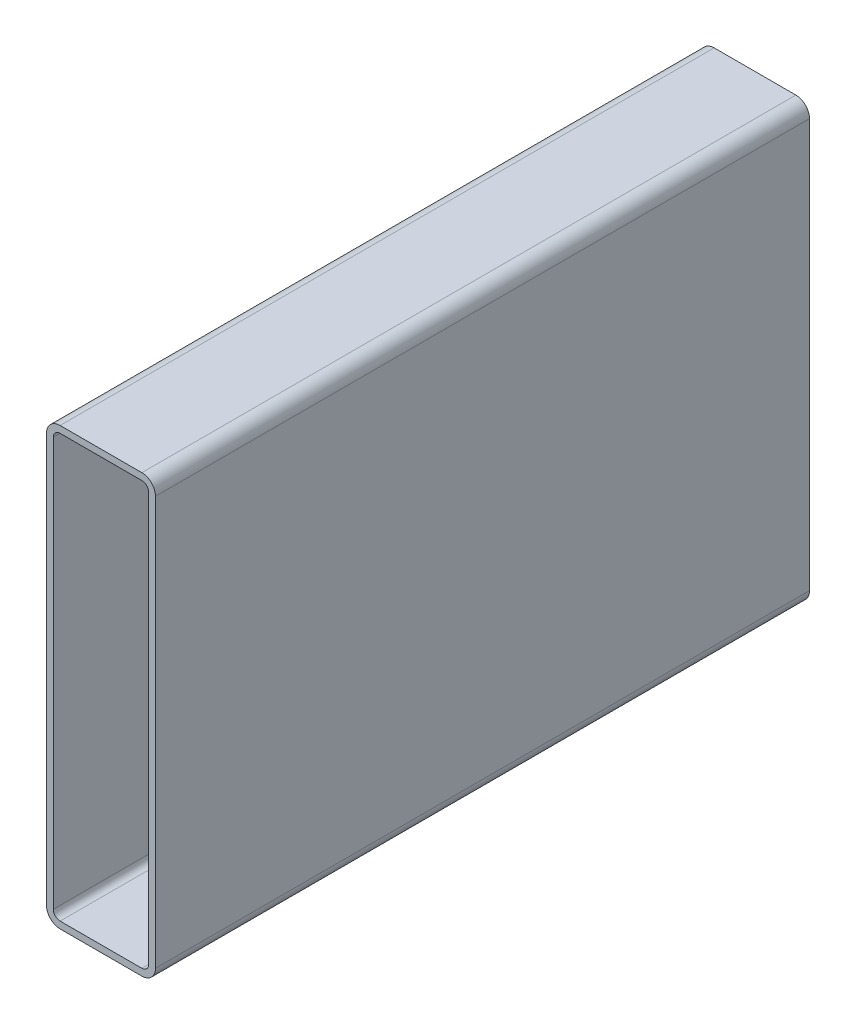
ISO-10303-21;
HEADER;
FILE_DESCRIPTION(('STEP AP214'),'2;1');
FILE_NAME('part.step','',(''),(''),'','','');
FILE_SCHEMA(('AUTOMOTIVE_DESIGN { 1 0 10303 214 1 1 1 1 }'));
ENDSEC;
DATA;
#1=APPLICATION_CONTEXT('core data for automotive mechanical design processes');
#2=APPLICATION_PROTOCOL_DEFINITION('international standard','automotive_design',2000,#1);
#3=PRODUCT_CONTEXT('',#1,'mechanical');
#4=PRODUCT('Part','Part','',(#3));
#5=PRODUCT_RELATED_PRODUCT_CATEGORY('part','',(#4));
#6=PRODUCT_DEFINITION_FORMATION('','',#4);
#7=PRODUCT_DEFINITION_CONTEXT('part definition',#1,'design');
#8=PRODUCT_DEFINITION('design','',#6,#7);
#9=PRODUCT_DEFINITION_SHAPE('','',#8);
#10=(LENGTH_UNIT() NAMED_UNIT(*) SI_UNIT(.MILLI.,.METRE.));
#11=(NAMED_UNIT(*) PLANE_ANGLE_UNIT() SI_UNIT($,.RADIAN.));
#12=(NAMED_UNIT(*) SI_UNIT($,.STERADIAN.) SOLID_ANGLE_UNIT());
#13=UNCERTAINTY_MEASURE_WITH_UNIT(LENGTH_MEASURE(1.E-05),#10,'distance_accuracy_value','');
#14=(GEOMETRIC_REPRESENTATION_CONTEXT(3) GLOBAL_UNCERTAINTY_ASSIGNED_CONTEXT((#13)) GLOBAL_UNIT_ASSIGNED_CONTEXT((#10,
#11,#12)) REPRESENTATION_CONTEXT('',''));
#15=CARTESIAN_POINT('',(0.,0.,0.));
#16=DIRECTION('',(0.,0.,1.));
#17=DIRECTION('',(1.,0.,0.));
#18=AXIS2_PLACEMENT_3D('',#15,#16,#17);
#19=CARTESIAN_POINT('',(6.35,196.85,304.8));
#20=DIRECTION('',(0.,0.,1.));
#21=DIRECTION('',(1.,0.,0.));
#22=AXIS2_PLACEMENT_3D('',#19,#20,#21);
#23=PLANE('',#22);
#24=CARTESIAN_POINT('',(6.35,196.85,304.8));
#25=DIRECTION('',(0.,0.,1.));
#26=DIRECTION('',(1.,0.,0.));
#27=AXIS2_PLACEMENT_3D('',#24,#25,#26);
#28=CIRCLE('',#27,6.35);
#29=CARTESIAN_POINT('',(6.35,203.2,304.8));
#30=VERTEX_POINT('',#29);
#31=CARTESIAN_POINT('',(0.,196.85,304.8));
#32=VERTEX_POINT('',#31);
#33=EDGE_CURVE('E211',#30,#32,#28,.T.);
#34=ORIENTED_EDGE('',*,*,#33,.T.);
#35=DIRECTION('',(0.,-1.,0.));
#36=VECTOR('',#35,1.);
#37=CARTESIAN_POINT('',(0.,6.35,304.8));
#38=LINE('',#37,#36);
#39=CARTESIAN_POINT('',(0.,6.35,304.8));
#40=VERTEX_POINT('',#39);
#41=EDGE_CURVE('E214',#32,#40,#38,.T.);
#42=ORIENTED_EDGE('',*,*,#41,.T.);
#43=CARTESIAN_POINT('',(6.35,6.35,304.8));
#44=DIRECTION('',(0.,0.,1.));
#45=DIRECTION('',(1.,0.,0.));
#46=AXIS2_PLACEMENT_3D('',#43,#44,#45);
#47=CIRCLE('',#46,6.35);
#48=CARTESIAN_POINT('',(6.35,0.,304.8));
#49=VERTEX_POINT('',#48);
#50=EDGE_CURVE('E217',#40,#49,#47,.T.);
#51=ORIENTED_EDGE('',*,*,#50,.T.);
#52=DIRECTION('',(1.,0.,0.));
#53=VECTOR('',#52,1.);
#54=CARTESIAN_POINT('',(44.45,0.,304.8));
#55=LINE('',#54,#53);
#56=CARTESIAN_POINT('',(44.45,0.,304.8));
#57=VERTEX_POINT('',#56);
#58=EDGE_CURVE('E219',#49,#57,#55,.T.);
#59=ORIENTED_EDGE('',*,*,#58,.T.);
#60=CARTESIAN_POINT('',(44.45,6.35,304.8));
#61=DIRECTION('',(0.,0.,1.));
#62=DIRECTION('',(1.,0.,0.));
#63=AXIS2_PLACEMENT_3D('',#60,#61,#62);
#64=CIRCLE('',#63,6.35);
#65=CARTESIAN_POINT('',(50.8,6.35,304.8));
#66=VERTEX_POINT('',#65);
#67=EDGE_CURVE('E221',#57,#66,#64,.T.);
#68=ORIENTED_EDGE('',*,*,#67,.T.);
#69=DIRECTION('',(0.,1.,0.));
#70=VECTOR('',#69,1.);
#71=CARTESIAN_POINT('',(50.8,196.85,304.8));
#72=LINE('',#71,#70);
#73=CARTESIAN_POINT('',(50.8,196.85,304.8));
#74=VERTEX_POINT('',#73);
#75=EDGE_CURVE('E223',#66,#74,#72,.T.);
#76=ORIENTED_EDGE('',*,*,#75,.T.);
#77=CARTESIAN_POINT('',(44.45,196.85,304.8));
#78=DIRECTION('',(0.,0.,1.));
#79=DIRECTION('',(1.,0.,0.));
#80=AXIS2_PLACEMENT_3D('',#77,#78,#79);
#81=CIRCLE('',#80,6.35);
#82=CARTESIAN_POINT('',(44.45,203.2,304.8));
#83=VERTEX_POINT('',#82);
#84=EDGE_CURVE('E225',#74,#83,#81,.T.);
#85=ORIENTED_EDGE('',*,*,#84,.T.);
#86=DIRECTION('',(-1.,0.,0.));
#87=VECTOR('',#86,1.);
#88=CARTESIAN_POINT('',(6.35,203.2,304.8));
#89=LINE('',#88,#87);
#90=EDGE_CURVE('E227',#83,#30,#89,.T.);
#91=ORIENTED_EDGE('',*,*,#90,.T.);
#92=EDGE_LOOP('',(#34,#42,#51,#59,#68,#76,#85,#91));
#93=FACE_BOUND('',#92,.T.);
#94=DIRECTION('',(0.,-1.,0.));
#95=VECTOR('',#94,1.);
#96=CARTESIAN_POINT('',(3.175,6.35,304.8));
#97=LINE('',#96,#95);
#98=CARTESIAN_POINT('',(3.175,196.85,304.8));
#99=VERTEX_POINT('',#98);
#100=CARTESIAN_POINT('',(3.175,6.35,304.8));
#101=VERTEX_POINT('',#100);
#102=EDGE_CURVE('E154',#99,#101,#97,.T.);
#103=ORIENTED_EDGE('',*,*,#102,.F.);
#104=CARTESIAN_POINT('',(6.35,196.85,304.8));
#105=DIRECTION('',(0.,0.,1.));
#106=DIRECTION('',(1.,0.,0.));
#107=AXIS2_PLACEMENT_3D('',#104,#105,#106);
#108=CIRCLE('',#107,3.17499999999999);
#109=CARTESIAN_POINT('',(6.35,200.025,304.8));
#110=VERTEX_POINT('',#109);
#111=EDGE_CURVE('E146',#110,#99,#108,.T.);
#112=ORIENTED_EDGE('',*,*,#111,.F.);
#113=DIRECTION('',(-1.,0.,0.));
#114=VECTOR('',#113,1.);
#115=CARTESIAN_POINT('',(6.35,200.025,304.8));
#116=LINE('',#115,#114);
#117=CARTESIAN_POINT('',(44.45,200.025,304.8));
#118=VERTEX_POINT('',#117);
#119=EDGE_CURVE('E179',#118,#110,#116,.T.);
#120=ORIENTED_EDGE('',*,*,#119,.F.);
#121=CARTESIAN_POINT('',(44.45,196.85,304.8));
#122=DIRECTION('',(0.,0.,1.));
#123=DIRECTION('',(1.,0.,0.));
#124=AXIS2_PLACEMENT_3D('',#121,#122,#123);
#125=CIRCLE('',#124,3.17499999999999);
#126=CARTESIAN_POINT('',(47.625,196.85,304.8));
#127=VERTEX_POINT('',#126);
#128=EDGE_CURVE('E177',#127,#118,#125,.T.);
#129=ORIENTED_EDGE('',*,*,#128,.F.);
#130=DIRECTION('',(0.,1.,0.));
#131=VECTOR('',#130,1.);
#132=CARTESIAN_POINT('',(47.625,196.85,304.8));
#133=LINE('',#132,#131);
#134=CARTESIAN_POINT('',(47.625,6.35,304.8));
#135=VERTEX_POINT('',#134);
#136=EDGE_CURVE('E175',#135,#127,#133,.T.);
#137=ORIENTED_EDGE('',*,*,#136,.F.);
#138=CARTESIAN_POINT('',(44.45,6.35,304.8));
#139=DIRECTION('',(0.,0.,1.));
#140=DIRECTION('',(1.,0.,0.));
#141=AXIS2_PLACEMENT_3D('',#138,#139,#140);
#142=CIRCLE('',#141,3.175);
#143=CARTESIAN_POINT('',(44.45,3.175,304.8));
#144=VERTEX_POINT('',#143);
#145=EDGE_CURVE('E173',#144,#135,#142,.T.);
#146=ORIENTED_EDGE('',*,*,#145,.F.);
#147=DIRECTION('',(1.,0.,0.));
#148=VECTOR('',#147,1.);
#149=CARTESIAN_POINT('',(44.45,3.175,304.8));
#150=LINE('',#149,#148);
#151=CARTESIAN_POINT('',(6.35,3.175,304.8));
#152=VERTEX_POINT('',#151);
#153=EDGE_CURVE('E169',#152,#144,#150,.T.);
#154=ORIENTED_EDGE('',*,*,#153,.F.);
#155=CARTESIAN_POINT('',(6.35,6.35,304.8));
#156=DIRECTION('',(0.,0.,1.));
#157=DIRECTION('',(1.,0.,0.));
#158=AXIS2_PLACEMENT_3D('',#155,#156,#157);
#159=CIRCLE('',#158,3.175);
#160=EDGE_CURVE('E167',#101,#152,#159,.T.);
#161=ORIENTED_EDGE('',*,*,#160,.F.);
#162=EDGE_LOOP('',(#103,#112,#120,#129,#137,#146,#154,#161));
#163=FACE_BOUND('',#162,.T.);
#164=ADVANCED_FACE('F33',(#93,#163),#23,.T.);
#165=CARTESIAN_POINT('',(6.35,196.85,0.));
#166=DIRECTION('',(0.,0.,1.));
#167=DIRECTION('',(1.,0.,0.));
#168=AXIS2_PLACEMENT_3D('',#165,#166,#167);
#169=PLANE('',#168);
#170=CARTESIAN_POINT('',(6.35,196.85,0.));
#171=DIRECTION('',(0.,0.,1.));
#172=DIRECTION('',(1.,0.,0.));
#173=AXIS2_PLACEMENT_3D('',#170,#171,#172);
#174=CIRCLE('',#173,6.35);
#175=CARTESIAN_POINT('',(6.35,203.2,0.));
#176=VERTEX_POINT('',#175);
#177=CARTESIAN_POINT('',(0.,196.85,0.));
#178=VERTEX_POINT('',#177);
#179=EDGE_CURVE('E162',#176,#178,#174,.T.);
#180=ORIENTED_EDGE('',*,*,#179,.F.);
#181=DIRECTION('',(-1.,0.,0.));
#182=VECTOR('',#181,1.);
#183=CARTESIAN_POINT('',(6.35,203.2,0.));
#184=LINE('',#183,#182);
#185=CARTESIAN_POINT('',(44.45,203.2,0.));
#186=VERTEX_POINT('',#185);
#187=EDGE_CURVE('E215',#186,#176,#184,.T.);
#188=ORIENTED_EDGE('',*,*,#187,.F.);
#189=CARTESIAN_POINT('',(44.45,196.85,0.));
#190=DIRECTION('',(0.,0.,1.));
#191=DIRECTION('',(1.,0.,0.));
#192=AXIS2_PLACEMENT_3D('',#189,#190,#191);
#193=CIRCLE('',#192,6.35);
#194=CARTESIAN_POINT('',(50.8,196.85,0.));
#195=VERTEX_POINT('',#194);
#196=EDGE_CURVE('E242',#195,#186,#193,.T.);
#197=ORIENTED_EDGE('',*,*,#196,.F.);
#198=DIRECTION('',(0.,1.,0.));
#199=VECTOR('',#198,1.);
#200=CARTESIAN_POINT('',(50.8,196.85,0.));
#201=LINE('',#200,#199);
#202=CARTESIAN_POINT('',(50.8,6.35,0.));
#203=VERTEX_POINT('',#202);
#204=EDGE_CURVE('E240',#203,#195,#201,.T.);
#205=ORIENTED_EDGE('',*,*,#204,.F.);
#206=CARTESIAN_POINT('',(44.45,6.35,0.));
#207=DIRECTION('',(0.,0.,1.));
#208=DIRECTION('',(1.,0.,0.));
#209=AXIS2_PLACEMENT_3D('',#206,#207,#208);
#210=CIRCLE('',#209,6.35);
#211=CARTESIAN_POINT('',(44.45,0.,0.));
#212=VERTEX_POINT('',#211);
#213=EDGE_CURVE('E238',#212,#203,#210,.T.);
#214=ORIENTED_EDGE('',*,*,#213,.F.);
#215=DIRECTION('',(1.,0.,0.));
#216=VECTOR('',#215,1.);
#217=CARTESIAN_POINT('',(44.45,0.,0.));
#218=LINE('',#217,#216);
#219=CARTESIAN_POINT('',(6.35,0.,0.));
#220=VERTEX_POINT('',#219);
#221=EDGE_CURVE('E236',#220,#212,#218,.T.);
#222=ORIENTED_EDGE('',*,*,#221,.F.);
#223=CARTESIAN_POINT('',(6.35,6.35,0.));
#224=DIRECTION('',(0.,0.,1.));
#225=DIRECTION('',(1.,0.,0.));
#226=AXIS2_PLACEMENT_3D('',#223,#224,#225);
#227=CIRCLE('',#226,6.35);
#228=CARTESIAN_POINT('',(0.,6.35,0.));
#229=VERTEX_POINT('',#228);
#230=EDGE_CURVE('E234',#229,#220,#227,.T.);
#231=ORIENTED_EDGE('',*,*,#230,.F.);
#232=DIRECTION('',(0.,-1.,0.));
#233=VECTOR('',#232,1.);
#234=CARTESIAN_POINT('',(0.,6.35,0.));
#235=LINE('',#234,#233);
#236=EDGE_CURVE('E232',#178,#229,#235,.T.);
#237=ORIENTED_EDGE('',*,*,#236,.F.);
#238=EDGE_LOOP('',(#180,#188,#197,#205,#214,#222,#231,#237));
#239=FACE_BOUND('',#238,.T.);
#240=CARTESIAN_POINT('',(6.35,196.85,0.));
#241=DIRECTION('',(0.,0.,1.));
#242=DIRECTION('',(1.,0.,0.));
#243=AXIS2_PLACEMENT_3D('',#240,#241,#242);
#244=CIRCLE('',#243,3.17499999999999);
#245=CARTESIAN_POINT('',(6.35,200.025,0.));
#246=VERTEX_POINT('',#245);
#247=CARTESIAN_POINT('',(3.175,196.85,0.));
#248=VERTEX_POINT('',#247);
#249=EDGE_CURVE('E56',#246,#248,#244,.T.);
#250=ORIENTED_EDGE('',*,*,#249,.T.);
#251=DIRECTION('',(0.,-1.,0.));
#252=VECTOR('',#251,1.);
#253=CARTESIAN_POINT('',(3.175,6.35,0.));
#254=LINE('',#253,#252);
#255=CARTESIAN_POINT('',(3.175,6.35,0.));
#256=VERTEX_POINT('',#255);
#257=EDGE_CURVE('E161',#248,#256,#254,.T.);
#258=ORIENTED_EDGE('',*,*,#257,.T.);
#259=CARTESIAN_POINT('',(6.35,6.35,0.));
#260=DIRECTION('',(0.,0.,1.));
#261=DIRECTION('',(1.,0.,0.));
#262=AXIS2_PLACEMENT_3D('',#259,#260,#261);
#263=CIRCLE('',#262,3.175);
#264=CARTESIAN_POINT('',(6.35,3.175,0.));
#265=VERTEX_POINT('',#264);
#266=EDGE_CURVE('E183',#256,#265,#263,.T.);
#267=ORIENTED_EDGE('',*,*,#266,.T.);
#268=DIRECTION('',(1.,0.,0.));
#269=VECTOR('',#268,1.);
#270=CARTESIAN_POINT('',(44.45,3.175,0.));
#271=LINE('',#270,#269);
#272=CARTESIAN_POINT('',(44.45,3.175,0.));
#273=VERTEX_POINT('',#272);
#274=EDGE_CURVE('E186',#265,#273,#271,.T.);
#275=ORIENTED_EDGE('',*,*,#274,.T.);
#276=CARTESIAN_POINT('',(44.45,6.35,0.));
#277=DIRECTION('',(0.,0.,1.));
#278=DIRECTION('',(1.,0.,0.));
#279=AXIS2_PLACEMENT_3D('',#276,#277,#278);
#280=CIRCLE('',#279,3.175);
#281=CARTESIAN_POINT('',(47.625,6.35,0.));
#282=VERTEX_POINT('',#281);
#283=EDGE_CURVE('E189',#273,#282,#280,.T.);
#284=ORIENTED_EDGE('',*,*,#283,.T.);
#285=DIRECTION('',(0.,1.,0.));
#286=VECTOR('',#285,1.);
#287=CARTESIAN_POINT('',(47.625,196.85,0.));
#288=LINE('',#287,#286);
#289=CARTESIAN_POINT('',(47.625,196.85,0.));
#290=VERTEX_POINT('',#289);
#291=EDGE_CURVE('E192',#282,#290,#288,.T.);
#292=ORIENTED_EDGE('',*,*,#291,.T.);
#293=CARTESIAN_POINT('',(44.45,196.85,0.));
#294=DIRECTION('',(0.,0.,1.));
#295=DIRECTION('',(1.,0.,0.));
#296=AXIS2_PLACEMENT_3D('',#293,#294,#295);
#297=CIRCLE('',#296,3.17499999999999);
#298=CARTESIAN_POINT('',(44.45,200.025,0.));
#299=VERTEX_POINT('',#298);
#300=EDGE_CURVE('E195',#290,#299,#297,.T.);
#301=ORIENTED_EDGE('',*,*,#300,.T.);
#302=DIRECTION('',(-1.,0.,0.));
#303=VECTOR('',#302,1.);
#304=CARTESIAN_POINT('',(6.35,200.025,0.));
#305=LINE('',#304,#303);
#306=EDGE_CURVE('E155',#299,#246,#305,.T.);
#307=ORIENTED_EDGE('',*,*,#306,.T.);
#308=EDGE_LOOP('',(#250,#258,#267,#275,#284,#292,#301,#307));
#309=FACE_BOUND('',#308,.T.);
#310=ADVANCED_FACE('F272',(#239,#309),#169,.F.);
#311=CARTESIAN_POINT('',(6.35,196.85,304.8));
#312=DIRECTION('',(0.,0.,-1.));
#313=DIRECTION('',(-1.,0.,0.));
#314=AXIS2_PLACEMENT_3D('',#311,#312,#313);
#315=CYLINDRICAL_SURFACE('',#314,6.35);
#316=ORIENTED_EDGE('',*,*,#179,.T.);
#317=DIRECTION('',(0.,0.,-1.));
#318=VECTOR('',#317,1.);
#319=CARTESIAN_POINT('',(0.,196.85,304.8));
#320=LINE('',#319,#318);
#321=EDGE_CURVE('E11',#32,#178,#320,.T.);
#322=ORIENTED_EDGE('',*,*,#321,.F.);
#323=ORIENTED_EDGE('',*,*,#33,.F.);
#324=DIRECTION('',(0.,0.,-1.));
#325=VECTOR('',#324,1.);
#326=CARTESIAN_POINT('',(6.35,203.2,304.8));
#327=LINE('',#326,#325);
#328=EDGE_CURVE('E229',#30,#176,#327,.T.);
#329=ORIENTED_EDGE('',*,*,#328,.T.);
#330=EDGE_LOOP('',(#316,#322,#323,#329));
#331=FACE_BOUND('',#330,.T.);
#332=ADVANCED_FACE('F35',(#331),#315,.T.);
#333=CARTESIAN_POINT('',(0.,6.35,304.8));
#334=DIRECTION('',(1.,0.,0.));
#335=DIRECTION('',(0.,0.,-1.));
#336=AXIS2_PLACEMENT_3D('',#333,#334,#335);
#337=PLANE('',#336);
#338=ORIENTED_EDGE('',*,*,#236,.T.);
#339=DIRECTION('',(0.,0.,-1.));
#340=VECTOR('',#339,1.);
#341=CARTESIAN_POINT('',(0.,6.35,304.8));
#342=LINE('',#341,#340);
#343=EDGE_CURVE('E41',#40,#229,#342,.T.);
#344=ORIENTED_EDGE('',*,*,#343,.F.);
#345=ORIENTED_EDGE('',*,*,#41,.F.);
#346=ORIENTED_EDGE('',*,*,#321,.T.);
#347=EDGE_LOOP('',(#338,#344,#345,#346));
#348=FACE_BOUND('',#347,.T.);
#349=ADVANCED_FACE('F289',(#348),#337,.F.);
#350=CARTESIAN_POINT('',(6.35,6.35,304.8));
#351=DIRECTION('',(0.,0.,-1.));
#352=DIRECTION('',(-1.,0.,0.));
#353=AXIS2_PLACEMENT_3D('',#350,#351,#352);
#354=CYLINDRICAL_SURFACE('',#353,6.35);
#355=ORIENTED_EDGE('',*,*,#230,.T.);
#356=DIRECTION('',(0.,0.,-1.));
#357=VECTOR('',#356,1.);
#358=CARTESIAN_POINT('',(6.35,0.,304.8));
#359=LINE('',#358,#357);
#360=EDGE_CURVE('E259',#49,#220,#359,.T.);
#361=ORIENTED_EDGE('',*,*,#360,.F.);
#362=ORIENTED_EDGE('',*,*,#50,.F.);
#363=ORIENTED_EDGE('',*,*,#343,.T.);
#364=EDGE_LOOP('',(#355,#361,#362,#363));
#365=FACE_BOUND('',#364,.T.);
#366=ADVANCED_FACE('F266',(#365),#354,.T.);
#367=CARTESIAN_POINT('',(44.45,0.,304.8));
#368=DIRECTION('',(0.,1.,0.));
#369=DIRECTION('',(0.,0.,1.));
#370=AXIS2_PLACEMENT_3D('',#367,#368,#369);
#371=PLANE('',#370);
#372=ORIENTED_EDGE('',*,*,#221,.T.);
#373=DIRECTION('',(0.,0.,-1.));
#374=VECTOR('',#373,1.);
#375=CARTESIAN_POINT('',(44.45,0.,304.8));
#376=LINE('',#375,#374);
#377=EDGE_CURVE('E256',#57,#212,#376,.T.);
#378=ORIENTED_EDGE('',*,*,#377,.F.);
#379=ORIENTED_EDGE('',*,*,#58,.F.);
#380=ORIENTED_EDGE('',*,*,#360,.T.);
#381=EDGE_LOOP('',(#372,#378,#379,#380));
#382=FACE_BOUND('',#381,.T.);
#383=ADVANCED_FACE('F278',(#382),#371,.F.);
#384=CARTESIAN_POINT('',(44.45,6.35,304.8));
#385=DIRECTION('',(0.,0.,-1.));
#386=DIRECTION('',(-1.,0.,0.));
#387=AXIS2_PLACEMENT_3D('',#384,#385,#386);
#388=CYLINDRICAL_SURFACE('',#387,6.35);
#389=ORIENTED_EDGE('',*,*,#213,.T.);
#390=DIRECTION('',(0.,0.,-1.));
#391=VECTOR('',#390,1.);
#392=CARTESIAN_POINT('',(50.8,6.35,304.8));
#393=LINE('',#392,#391);
#394=EDGE_CURVE('E253',#66,#203,#393,.T.);
#395=ORIENTED_EDGE('',*,*,#394,.F.);
#396=ORIENTED_EDGE('',*,*,#67,.F.);
#397=ORIENTED_EDGE('',*,*,#377,.T.);
#398=EDGE_LOOP('',(#389,#395,#396,#397));
#399=FACE_BOUND('',#398,.T.);
#400=ADVANCED_FACE('F282',(#399),#388,.T.);
#401=CARTESIAN_POINT('',(50.8,196.85,304.8));
#402=DIRECTION('',(-1.,0.,0.));
#403=DIRECTION('',(0.,0.,1.));
#404=AXIS2_PLACEMENT_3D('',#401,#402,#403);
#405=PLANE('',#404);
#406=ORIENTED_EDGE('',*,*,#204,.T.);
#407=DIRECTION('',(0.,0.,-1.));
#408=VECTOR('',#407,1.);
#409=CARTESIAN_POINT('',(50.8,196.85,304.8));
#410=LINE('',#409,#408);
#411=EDGE_CURVE('E250',#74,#195,#410,.T.);
#412=ORIENTED_EDGE('',*,*,#411,.F.);
#413=ORIENTED_EDGE('',*,*,#75,.F.);
#414=ORIENTED_EDGE('',*,*,#394,.T.);
#415=EDGE_LOOP('',(#406,#412,#413,#414));
#416=FACE_BOUND('',#415,.T.);
#417=ADVANCED_FACE('F302',(#416),#405,.F.);
#418=CARTESIAN_POINT('',(44.45,196.85,304.8));
#419=DIRECTION('',(0.,0.,-1.));
#420=DIRECTION('',(-1.,0.,0.));
#421=AXIS2_PLACEMENT_3D('',#418,#419,#420);
#422=CYLINDRICAL_SURFACE('',#421,6.35);
#423=ORIENTED_EDGE('',*,*,#196,.T.);
#424=DIRECTION('',(0.,0.,-1.));
#425=VECTOR('',#424,1.);
#426=CARTESIAN_POINT('',(44.45,203.2,304.8));
#427=LINE('',#426,#425);
#428=EDGE_CURVE('E247',#83,#186,#427,.T.);
#429=ORIENTED_EDGE('',*,*,#428,.F.);
#430=ORIENTED_EDGE('',*,*,#84,.F.);
#431=ORIENTED_EDGE('',*,*,#411,.T.);
#432=EDGE_LOOP('',(#423,#429,#430,#431));
#433=FACE_BOUND('',#432,.T.);
#434=ADVANCED_FACE('F300',(#433),#422,.T.);
#435=CARTESIAN_POINT('',(6.35,203.2,304.8));
#436=DIRECTION('',(0.,-1.,0.));
#437=DIRECTION('',(0.,0.,-1.));
#438=AXIS2_PLACEMENT_3D('',#435,#436,#437);
#439=PLANE('',#438);
#440=ORIENTED_EDGE('',*,*,#187,.T.);
#441=ORIENTED_EDGE('',*,*,#328,.F.);
#442=ORIENTED_EDGE('',*,*,#90,.F.);
#443=ORIENTED_EDGE('',*,*,#428,.T.);
#444=EDGE_LOOP('',(#440,#441,#442,#443));
#445=FACE_BOUND('',#444,.T.);
#446=ADVANCED_FACE('F295',(#445),#439,.F.);
#447=CARTESIAN_POINT('',(6.35,196.85,304.8));
#448=DIRECTION('',(0.,0.,-1.));
#449=DIRECTION('',(-1.,0.,0.));
#450=AXIS2_PLACEMENT_3D('',#447,#448,#449);
#451=CYLINDRICAL_SURFACE('',#450,3.17499999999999);
#452=ORIENTED_EDGE('',*,*,#249,.F.);
#453=DIRECTION('',(0.,0.,-1.));
#454=VECTOR('',#453,1.);
#455=CARTESIAN_POINT('',(6.35,200.025,304.8));
#456=LINE('',#455,#454);
#457=EDGE_CURVE('E150',#110,#246,#456,.T.);
#458=ORIENTED_EDGE('',*,*,#457,.F.);
#459=ORIENTED_EDGE('',*,*,#111,.T.);
#460=DIRECTION('',(0.,0.,-1.));
#461=VECTOR('',#460,1.);
#462=CARTESIAN_POINT('',(3.175,196.85,304.8));
#463=LINE('',#462,#461);
#464=EDGE_CURVE('E149',#99,#248,#463,.T.);
#465=ORIENTED_EDGE('',*,*,#464,.T.);
#466=EDGE_LOOP('',(#452,#458,#459,#465));
#467=FACE_BOUND('',#466,.T.);
#468=ADVANCED_FACE('F148',(#467),#451,.F.);
#469=CARTESIAN_POINT('',(3.175,6.35,304.8));
#470=DIRECTION('',(1.,0.,0.));
#471=DIRECTION('',(0.,0.,-1.));
#472=AXIS2_PLACEMENT_3D('',#469,#470,#471);
#473=PLANE('',#472);
#474=ORIENTED_EDGE('',*,*,#257,.F.);
#475=ORIENTED_EDGE('',*,*,#464,.F.);
#476=ORIENTED_EDGE('',*,*,#102,.T.);
#477=DIRECTION('',(0.,0.,-1.));
#478=VECTOR('',#477,1.);
#479=CARTESIAN_POINT('',(3.175,6.35,304.8));
#480=LINE('',#479,#478);
#481=EDGE_CURVE('E163',#101,#256,#480,.T.);
#482=ORIENTED_EDGE('',*,*,#481,.T.);
#483=EDGE_LOOP('',(#474,#475,#476,#482));
#484=FACE_BOUND('',#483,.T.);
#485=ADVANCED_FACE('F158',(#484),#473,.T.);
#486=CARTESIAN_POINT('',(6.35,6.35,304.8));
#487=DIRECTION('',(0.,0.,-1.));
#488=DIRECTION('',(-1.,0.,0.));
#489=AXIS2_PLACEMENT_3D('',#486,#487,#488);
#490=CYLINDRICAL_SURFACE('',#489,3.175);
#491=ORIENTED_EDGE('',*,*,#266,.F.);
#492=ORIENTED_EDGE('',*,*,#481,.F.);
#493=ORIENTED_EDGE('',*,*,#160,.T.);
#494=DIRECTION('',(0.,0.,-1.));
#495=VECTOR('',#494,1.);
#496=CARTESIAN_POINT('',(6.35,3.175,304.8));
#497=LINE('',#496,#495);
#498=EDGE_CURVE('E208',#152,#265,#497,.T.);
#499=ORIENTED_EDGE('',*,*,#498,.T.);
#500=EDGE_LOOP('',(#491,#492,#493,#499));
#501=FACE_BOUND('',#500,.T.);
#502=ADVANCED_FACE('F327',(#501),#490,.F.);
#503=CARTESIAN_POINT('',(44.45,3.175,304.8));
#504=DIRECTION('',(0.,1.,0.));
#505=DIRECTION('',(0.,0.,1.));
#506=AXIS2_PLACEMENT_3D('',#503,#504,#505);
#507=PLANE('',#506);
#508=ORIENTED_EDGE('',*,*,#274,.F.);
#509=ORIENTED_EDGE('',*,*,#498,.F.);
#510=ORIENTED_EDGE('',*,*,#153,.T.);
#511=DIRECTION('',(0.,0.,-1.));
#512=VECTOR('',#511,1.);
#513=CARTESIAN_POINT('',(44.45,3.175,304.8));
#514=LINE('',#513,#512);
#515=EDGE_CURVE('E206',#144,#273,#514,.T.);
#516=ORIENTED_EDGE('',*,*,#515,.T.);
#517=EDGE_LOOP('',(#508,#509,#510,#516));
#518=FACE_BOUND('',#517,.T.);
#519=ADVANCED_FACE('F331',(#518),#507,.T.);
#520=CARTESIAN_POINT('',(44.45,6.35,304.8));
#521=DIRECTION('',(0.,0.,-1.));
#522=DIRECTION('',(-1.,0.,0.));
#523=AXIS2_PLACEMENT_3D('',#520,#521,#522);
#524=CYLINDRICAL_SURFACE('',#523,3.175);
#525=ORIENTED_EDGE('',*,*,#283,.F.);
#526=ORIENTED_EDGE('',*,*,#515,.F.);
#527=ORIENTED_EDGE('',*,*,#145,.T.);
#528=DIRECTION('',(0.,0.,-1.));
#529=VECTOR('',#528,1.);
#530=CARTESIAN_POINT('',(47.625,6.35,304.8));
#531=LINE('',#530,#529);
#532=EDGE_CURVE('E204',#135,#282,#531,.T.);
#533=ORIENTED_EDGE('',*,*,#532,.T.);
#534=EDGE_LOOP('',(#525,#526,#527,#533));
#535=FACE_BOUND('',#534,.T.);
#536=ADVANCED_FACE('F337',(#535),#524,.F.);
#537=CARTESIAN_POINT('',(47.625,196.85,304.8));
#538=DIRECTION('',(-1.,0.,0.));
#539=DIRECTION('',(0.,0.,1.));
#540=AXIS2_PLACEMENT_3D('',#537,#538,#539);
#541=PLANE('',#540);
#542=ORIENTED_EDGE('',*,*,#291,.F.);
#543=ORIENTED_EDGE('',*,*,#532,.F.);
#544=ORIENTED_EDGE('',*,*,#136,.T.);
#545=DIRECTION('',(0.,0.,-1.));
#546=VECTOR('',#545,1.);
#547=CARTESIAN_POINT('',(47.625,196.85,304.8));
#548=LINE('',#547,#546);
#549=EDGE_CURVE('E202',#127,#290,#548,.T.);
#550=ORIENTED_EDGE('',*,*,#549,.T.);
#551=EDGE_LOOP('',(#542,#543,#544,#550));
#552=FACE_BOUND('',#551,.T.);
#553=ADVANCED_FACE('F341',(#552),#541,.T.);
#554=CARTESIAN_POINT('',(44.45,196.85,304.8));
#555=DIRECTION('',(0.,0.,-1.));
#556=DIRECTION('',(-1.,0.,0.));
#557=AXIS2_PLACEMENT_3D('',#554,#555,#556);
#558=CYLINDRICAL_SURFACE('',#557,3.17499999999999);
#559=ORIENTED_EDGE('',*,*,#300,.F.);
#560=ORIENTED_EDGE('',*,*,#549,.F.);
#561=ORIENTED_EDGE('',*,*,#128,.T.);
#562=DIRECTION('',(0.,0.,-1.));
#563=VECTOR('',#562,1.);
#564=CARTESIAN_POINT('',(44.45,200.025,304.8));
#565=LINE('',#564,#563);
#566=EDGE_CURVE('E48',#118,#299,#565,.T.);
#567=ORIENTED_EDGE('',*,*,#566,.T.);
#568=EDGE_LOOP('',(#559,#560,#561,#567));
#569=FACE_BOUND('',#568,.T.);
#570=ADVANCED_FACE('F345',(#569),#558,.F.);
#571=CARTESIAN_POINT('',(6.35,200.025,304.8));
#572=DIRECTION('',(0.,-1.,0.));
#573=DIRECTION('',(0.,0.,-1.));
#574=AXIS2_PLACEMENT_3D('',#571,#572,#573);
#575=PLANE('',#574);
#576=ORIENTED_EDGE('',*,*,#306,.F.);
#577=ORIENTED_EDGE('',*,*,#566,.F.);
#578=ORIENTED_EDGE('',*,*,#119,.T.);
#579=ORIENTED_EDGE('',*,*,#457,.T.);
#580=EDGE_LOOP('',(#576,#577,#578,#579));
#581=FACE_BOUND('',#580,.T.);
#582=ADVANCED_FACE('F349',(#581),#575,.T.);
#583=CLOSED_SHELL('',(#164,#310,#332,#349,#366,#383,#400,#417,#434,#446,#468,#485,#502,#519,
#536,#553,#570,#582));
#584=MANIFOLD_SOLID_BREP('B2',#583);
#585=ADVANCED_BREP_SHAPE_REPRESENTATION('',(#18,#584),#14);
#586=SHAPE_DEFINITION_REPRESENTATION(#9,#585);
ENDSEC;
END-ISO-10303-21;
